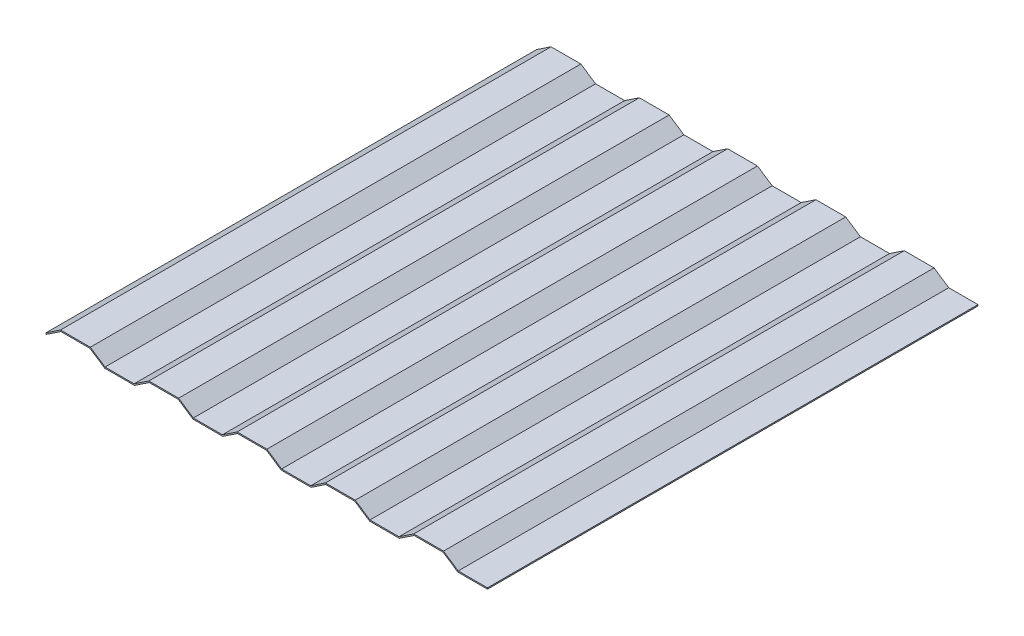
ISO-10303-21;
HEADER;
FILE_DESCRIPTION(('STEP AP214'),'2;1');
FILE_NAME('part.step','',(''),(''),'','','');
FILE_SCHEMA(('AUTOMOTIVE_DESIGN { 1 0 10303 214 1 1 1 1 }'));
ENDSEC;
DATA;
#1=APPLICATION_CONTEXT('core data for automotive mechanical design processes');
#2=APPLICATION_PROTOCOL_DEFINITION('international standard','automotive_design',2000,#1);
#3=PRODUCT_CONTEXT('',#1,'mechanical');
#4=PRODUCT('Part','Part','',(#3));
#5=PRODUCT_RELATED_PRODUCT_CATEGORY('part','',(#4));
#6=PRODUCT_DEFINITION_FORMATION('','',#4);
#7=PRODUCT_DEFINITION_CONTEXT('part definition',#1,'design');
#8=PRODUCT_DEFINITION('design','',#6,#7);
#9=PRODUCT_DEFINITION_SHAPE('','',#8);
#10=(LENGTH_UNIT() NAMED_UNIT(*) SI_UNIT(.MILLI.,.METRE.));
#11=(NAMED_UNIT(*) PLANE_ANGLE_UNIT() SI_UNIT($,.RADIAN.));
#12=(NAMED_UNIT(*) SI_UNIT($,.STERADIAN.) SOLID_ANGLE_UNIT());
#13=UNCERTAINTY_MEASURE_WITH_UNIT(LENGTH_MEASURE(1.E-05),#10,'distance_accuracy_value','');
#14=(GEOMETRIC_REPRESENTATION_CONTEXT(3) GLOBAL_UNCERTAINTY_ASSIGNED_CONTEXT((#13)) GLOBAL_UNIT_ASSIGNED_CONTEXT((#10,
#11,#12)) REPRESENTATION_CONTEXT('',''));
#15=CARTESIAN_POINT('',(0.,0.,0.));
#16=DIRECTION('',(0.,0.,1.));
#17=DIRECTION('',(1.,0.,0.));
#18=AXIS2_PLACEMENT_3D('',#15,#16,#17);
#19=CARTESIAN_POINT('',(420.18894341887,0.624037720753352,250.));
#20=DIRECTION('',(0.,1.,0.));
#21=DIRECTION('',(0.,0.,1.));
#22=AXIS2_PLACEMENT_3D('',#19,#20,#21);
#23=PLANE('',#22);
#24=DIRECTION('',(1.,0.,0.));
#25=VECTOR('',#24,1.);
#26=CARTESIAN_POINT('',(420.18894341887,0.624037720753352,250.));
#27=LINE('',#26,#25);
#28=CARTESIAN_POINT('',(420.18894341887,0.624037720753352,250.));
#29=VERTEX_POINT('',#28);
#30=CARTESIAN_POINT('',(450.,0.624037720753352,250.));
#31=VERTEX_POINT('',#30);
#32=EDGE_CURVE('E921',#29,#31,#27,.T.);
#33=ORIENTED_EDGE('',*,*,#32,.T.);
#34=DIRECTION('',(0.,0.,-1.));
#35=VECTOR('',#34,1.);
#36=CARTESIAN_POINT('',(450.,0.624037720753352,250.));
#37=LINE('',#36,#35);
#38=CARTESIAN_POINT('',(450.,0.624037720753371,-250.));
#39=VERTEX_POINT('',#38);
#40=EDGE_CURVE('E357',#31,#39,#37,.T.);
#41=ORIENTED_EDGE('',*,*,#40,.T.);
#42=DIRECTION('',(1.,0.,0.));
#43=VECTOR('',#42,1.);
#44=CARTESIAN_POINT('',(420.18894341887,0.62403772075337,-250.));
#45=LINE('',#44,#43);
#46=CARTESIAN_POINT('',(420.18894341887,0.62403772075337,-250.));
#47=VERTEX_POINT('',#46);
#48=EDGE_CURVE('E924',#47,#39,#45,.T.);
#49=ORIENTED_EDGE('',*,*,#48,.F.);
#50=DIRECTION('',(0.,0.,1.));
#51=VECTOR('',#50,1.);
#52=CARTESIAN_POINT('',(420.18894341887,0.624037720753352,250.));
#53=LINE('',#52,#51);
#54=EDGE_CURVE('E917',#47,#29,#53,.T.);
#55=ORIENTED_EDGE('',*,*,#54,.T.);
#56=EDGE_LOOP('',(#33,#41,#49,#55));
#57=FACE_BOUND('',#56,.T.);
#58=ADVANCED_FACE('F348',(#57),#23,.T.);
#59=CARTESIAN_POINT('',(419.81105658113,-0.624037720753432,250.));
#60=DIRECTION('',(0.,-1.,0.));
#61=DIRECTION('',(0.,0.,-1.));
#62=AXIS2_PLACEMENT_3D('',#59,#60,#61);
#63=PLANE('',#62);
#64=DIRECTION('',(1.,0.,0.));
#65=VECTOR('',#64,1.);
#66=CARTESIAN_POINT('',(419.81105658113,-0.624037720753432,-250.));
#67=LINE('',#66,#65);
#68=CARTESIAN_POINT('',(419.81105658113,-0.624037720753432,-250.));
#69=VERTEX_POINT('',#68);
#70=CARTESIAN_POINT('',(450.,-0.624037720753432,-250.));
#71=VERTEX_POINT('',#70);
#72=EDGE_CURVE('E926',#69,#71,#67,.T.);
#73=ORIENTED_EDGE('',*,*,#72,.T.);
#74=DIRECTION('',(0.,0.,1.));
#75=VECTOR('',#74,1.);
#76=CARTESIAN_POINT('',(450.,-0.624037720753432,250.));
#77=LINE('',#76,#75);
#78=CARTESIAN_POINT('',(450.,-0.624037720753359,250.));
#79=VERTEX_POINT('',#78);
#80=EDGE_CURVE('E352',#71,#79,#77,.T.);
#81=ORIENTED_EDGE('',*,*,#80,.T.);
#82=DIRECTION('',(1.,0.,0.));
#83=VECTOR('',#82,1.);
#84=CARTESIAN_POINT('',(419.81105658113,-0.624037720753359,250.));
#85=LINE('',#84,#83);
#86=CARTESIAN_POINT('',(419.81105658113,-0.624037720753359,250.));
#87=VERTEX_POINT('',#86);
#88=EDGE_CURVE('E928',#87,#79,#85,.T.);
#89=ORIENTED_EDGE('',*,*,#88,.F.);
#90=DIRECTION('',(0.,0.,-1.));
#91=VECTOR('',#90,1.);
#92=CARTESIAN_POINT('',(419.81105658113,-0.624037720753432,250.));
#93=LINE('',#92,#91);
#94=EDGE_CURVE('E918',#87,#69,#93,.T.);
#95=ORIENTED_EDGE('',*,*,#94,.T.);
#96=EDGE_LOOP('',(#73,#81,#89,#95));
#97=FACE_BOUND('',#96,.T.);
#98=ADVANCED_FACE('F350',(#97),#63,.T.);
#99=CARTESIAN_POINT('',(405.18894341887,10.6240377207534,250.));
#100=DIRECTION('',(-0.554700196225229,-0.832050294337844,0.));
#101=DIRECTION('',(0.832050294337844,-0.554700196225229,0.));
#102=AXIS2_PLACEMENT_3D('',#99,#100,#101);
#103=PLANE('',#102);
#104=ORIENTED_EDGE('',*,*,#54,.F.);
#105=DIRECTION('',(0.832050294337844,-0.554700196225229,0.));
#106=VECTOR('',#105,1.);
#107=CARTESIAN_POINT('',(405.18894341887,10.6240377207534,-250.));
#108=LINE('',#107,#106);
#109=CARTESIAN_POINT('',(405.18894341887,10.6240377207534,-250.));
#110=VERTEX_POINT('',#109);
#111=EDGE_CURVE('E907',#110,#47,#108,.T.);
#112=ORIENTED_EDGE('',*,*,#111,.F.);
#113=DIRECTION('',(0.,0.,-1.));
#114=VECTOR('',#113,1.);
#115=CARTESIAN_POINT('',(405.18894341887,10.6240377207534,250.));
#116=LINE('',#115,#114);
#117=CARTESIAN_POINT('',(405.18894341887,10.6240377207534,250.));
#118=VERTEX_POINT('',#117);
#119=EDGE_CURVE('E903',#118,#110,#116,.T.);
#120=ORIENTED_EDGE('',*,*,#119,.F.);
#121=DIRECTION('',(0.832050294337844,-0.554700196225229,0.));
#122=VECTOR('',#121,1.);
#123=CARTESIAN_POINT('',(405.18894341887,10.6240377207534,250.));
#124=LINE('',#123,#122);
#125=EDGE_CURVE('E904',#118,#29,#124,.T.);
#126=ORIENTED_EDGE('',*,*,#125,.T.);
#127=EDGE_LOOP('',(#104,#112,#120,#126));
#128=FACE_BOUND('',#127,.T.);
#129=ADVANCED_FACE('F1066',(#128),#103,.F.);
#130=CARTESIAN_POINT('',(404.81105658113,9.3759622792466,250.));
#131=DIRECTION('',(0.554700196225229,0.832050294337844,0.));
#132=DIRECTION('',(-0.832050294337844,0.554700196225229,0.));
#133=AXIS2_PLACEMENT_3D('',#130,#131,#132);
#134=PLANE('',#133);
#135=ORIENTED_EDGE('',*,*,#94,.F.);
#136=DIRECTION('',(0.832050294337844,-0.554700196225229,0.));
#137=VECTOR('',#136,1.);
#138=CARTESIAN_POINT('',(404.81105658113,9.37596227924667,250.));
#139=LINE('',#138,#137);
#140=CARTESIAN_POINT('',(404.81105658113,9.37596227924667,250.));
#141=VERTEX_POINT('',#140);
#142=EDGE_CURVE('E914',#141,#87,#139,.T.);
#143=ORIENTED_EDGE('',*,*,#142,.F.);
#144=DIRECTION('',(0.,0.,1.));
#145=VECTOR('',#144,1.);
#146=CARTESIAN_POINT('',(404.81105658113,9.3759622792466,250.));
#147=LINE('',#146,#145);
#148=CARTESIAN_POINT('',(404.81105658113,9.3759622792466,-250.));
#149=VERTEX_POINT('',#148);
#150=EDGE_CURVE('E908',#149,#141,#147,.T.);
#151=ORIENTED_EDGE('',*,*,#150,.F.);
#152=DIRECTION('',(0.832050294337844,-0.554700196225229,0.));
#153=VECTOR('',#152,1.);
#154=CARTESIAN_POINT('',(404.81105658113,9.3759622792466,-250.));
#155=LINE('',#154,#153);
#156=EDGE_CURVE('E911',#149,#69,#155,.T.);
#157=ORIENTED_EDGE('',*,*,#156,.T.);
#158=EDGE_LOOP('',(#135,#143,#151,#157));
#159=FACE_BOUND('',#158,.T.);
#160=ADVANCED_FACE('F1052',(#159),#134,.F.);
#161=CARTESIAN_POINT('',(374.81105658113,10.6240377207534,250.));
#162=DIRECTION('',(0.,1.,0.));
#163=DIRECTION('',(0.,0.,1.));
#164=AXIS2_PLACEMENT_3D('',#161,#162,#163);
#165=PLANE('',#164);
#166=DIRECTION('',(1.,0.,0.));
#167=VECTOR('',#166,1.);
#168=CARTESIAN_POINT('',(374.81105658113,10.6240377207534,250.));
#169=LINE('',#168,#167);
#170=CARTESIAN_POINT('',(374.81105658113,10.6240377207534,250.));
#171=VERTEX_POINT('',#170);
#172=EDGE_CURVE('E900',#171,#118,#169,.T.);
#173=ORIENTED_EDGE('',*,*,#172,.T.);
#174=ORIENTED_EDGE('',*,*,#119,.T.);
#175=DIRECTION('',(1.,0.,0.));
#176=VECTOR('',#175,1.);
#177=CARTESIAN_POINT('',(374.81105658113,10.6240377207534,-250.));
#178=LINE('',#177,#176);
#179=CARTESIAN_POINT('',(374.81105658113,10.6240377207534,-250.));
#180=VERTEX_POINT('',#179);
#181=EDGE_CURVE('E890',#180,#110,#178,.T.);
#182=ORIENTED_EDGE('',*,*,#181,.F.);
#183=DIRECTION('',(0.,0.,1.));
#184=VECTOR('',#183,1.);
#185=CARTESIAN_POINT('',(374.81105658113,10.6240377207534,250.));
#186=LINE('',#185,#184);
#187=EDGE_CURVE('E894',#180,#171,#186,.T.);
#188=ORIENTED_EDGE('',*,*,#187,.T.);
#189=EDGE_LOOP('',(#173,#174,#182,#188));
#190=FACE_BOUND('',#189,.T.);
#191=ADVANCED_FACE('F1070',(#190),#165,.T.);
#192=CARTESIAN_POINT('',(375.18894341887,9.3759622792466,250.));
#193=DIRECTION('',(0.,-1.,0.));
#194=DIRECTION('',(0.,0.,-1.));
#195=AXIS2_PLACEMENT_3D('',#192,#193,#194);
#196=PLANE('',#195);
#197=DIRECTION('',(1.,0.,0.));
#198=VECTOR('',#197,1.);
#199=CARTESIAN_POINT('',(375.18894341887,9.3759622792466,-250.));
#200=LINE('',#199,#198);
#201=CARTESIAN_POINT('',(375.18894341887,9.3759622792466,-250.));
#202=VERTEX_POINT('',#201);
#203=EDGE_CURVE('E893',#202,#149,#200,.T.);
#204=ORIENTED_EDGE('',*,*,#203,.T.);
#205=ORIENTED_EDGE('',*,*,#150,.T.);
#206=DIRECTION('',(1.,0.,0.));
#207=VECTOR('',#206,1.);
#208=CARTESIAN_POINT('',(375.18894341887,9.37596227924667,250.));
#209=LINE('',#208,#207);
#210=CARTESIAN_POINT('',(375.18894341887,9.37596227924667,250.));
#211=VERTEX_POINT('',#210);
#212=EDGE_CURVE('E897',#211,#141,#209,.T.);
#213=ORIENTED_EDGE('',*,*,#212,.F.);
#214=DIRECTION('',(0.,0.,-1.));
#215=VECTOR('',#214,1.);
#216=CARTESIAN_POINT('',(375.18894341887,9.3759622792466,250.));
#217=LINE('',#216,#215);
#218=EDGE_CURVE('E889',#211,#202,#217,.T.);
#219=ORIENTED_EDGE('',*,*,#218,.T.);
#220=EDGE_LOOP('',(#204,#205,#213,#219));
#221=FACE_BOUND('',#220,.T.);
#222=ADVANCED_FACE('F1049',(#221),#196,.T.);
#223=CARTESIAN_POINT('',(359.81105658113,0.624037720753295,250.));
#224=DIRECTION('',(0.554700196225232,-0.832050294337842,0.));
#225=DIRECTION('',(0.832050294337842,0.554700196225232,0.));
#226=AXIS2_PLACEMENT_3D('',#223,#224,#225);
#227=PLANE('',#226);
#228=ORIENTED_EDGE('',*,*,#187,.F.);
#229=DIRECTION('',(0.832050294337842,0.554700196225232,0.));
#230=VECTOR('',#229,1.);
#231=CARTESIAN_POINT('',(359.81105658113,0.624037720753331,-250.));
#232=LINE('',#231,#230);
#233=CARTESIAN_POINT('',(359.81105658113,0.624037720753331,-250.));
#234=VERTEX_POINT('',#233);
#235=EDGE_CURVE('E877',#234,#180,#232,.T.);
#236=ORIENTED_EDGE('',*,*,#235,.F.);
#237=DIRECTION('',(0.,0.,-1.));
#238=VECTOR('',#237,1.);
#239=CARTESIAN_POINT('',(359.81105658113,0.624037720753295,250.));
#240=LINE('',#239,#238);
#241=CARTESIAN_POINT('',(359.81105658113,0.624037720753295,250.));
#242=VERTEX_POINT('',#241);
#243=EDGE_CURVE('E873',#242,#234,#240,.T.);
#244=ORIENTED_EDGE('',*,*,#243,.F.);
#245=DIRECTION('',(0.832050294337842,0.554700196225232,0.));
#246=VECTOR('',#245,1.);
#247=CARTESIAN_POINT('',(359.81105658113,0.624037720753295,250.));
#248=LINE('',#247,#246);
#249=EDGE_CURVE('E886',#242,#171,#248,.T.);
#250=ORIENTED_EDGE('',*,*,#249,.T.);
#251=EDGE_LOOP('',(#228,#236,#244,#250));
#252=FACE_BOUND('',#251,.T.);
#253=ADVANCED_FACE('F1076',(#252),#227,.F.);
#254=CARTESIAN_POINT('',(360.18894341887,-0.62403772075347,250.));
#255=DIRECTION('',(-0.554700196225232,0.832050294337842,0.));
#256=DIRECTION('',(-0.832050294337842,-0.554700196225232,0.));
#257=AXIS2_PLACEMENT_3D('',#254,#255,#256);
#258=PLANE('',#257);
#259=ORIENTED_EDGE('',*,*,#218,.F.);
#260=DIRECTION('',(0.832050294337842,0.554700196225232,0.));
#261=VECTOR('',#260,1.);
#262=CARTESIAN_POINT('',(360.18894341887,-0.624037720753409,250.));
#263=LINE('',#262,#261);
#264=CARTESIAN_POINT('',(360.18894341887,-0.624037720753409,250.));
#265=VERTEX_POINT('',#264);
#266=EDGE_CURVE('E883',#265,#211,#263,.T.);
#267=ORIENTED_EDGE('',*,*,#266,.F.);
#268=DIRECTION('',(0.,0.,1.));
#269=VECTOR('',#268,1.);
#270=CARTESIAN_POINT('',(360.18894341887,-0.62403772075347,250.));
#271=LINE('',#270,#269);
#272=CARTESIAN_POINT('',(360.18894341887,-0.62403772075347,-250.));
#273=VERTEX_POINT('',#272);
#274=EDGE_CURVE('E876',#273,#265,#271,.T.);
#275=ORIENTED_EDGE('',*,*,#274,.F.);
#276=DIRECTION('',(0.832050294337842,0.554700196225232,0.));
#277=VECTOR('',#276,1.);
#278=CARTESIAN_POINT('',(360.18894341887,-0.62403772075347,-250.));
#279=LINE('',#278,#277);
#280=EDGE_CURVE('E880',#273,#202,#279,.T.);
#281=ORIENTED_EDGE('',*,*,#280,.T.);
#282=EDGE_LOOP('',(#259,#267,#275,#281));
#283=FACE_BOUND('',#282,.T.);
#284=ADVANCED_FACE('F1046',(#283),#258,.F.);
#285=CARTESIAN_POINT('',(329.81105658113,-0.62403772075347,250.));
#286=DIRECTION('',(0.,-1.,0.));
#287=DIRECTION('',(0.,0.,-1.));
#288=AXIS2_PLACEMENT_3D('',#285,#286,#287);
#289=PLANE('',#288);
#290=DIRECTION('',(1.,0.,0.));
#291=VECTOR('',#290,1.);
#292=CARTESIAN_POINT('',(329.81105658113,-0.62403772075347,-250.));
#293=LINE('',#292,#291);
#294=CARTESIAN_POINT('',(329.81105658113,-0.62403772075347,-250.));
#295=VERTEX_POINT('',#294);
#296=EDGE_CURVE('E861',#295,#273,#293,.T.);
#297=ORIENTED_EDGE('',*,*,#296,.T.);
#298=ORIENTED_EDGE('',*,*,#274,.T.);
#299=DIRECTION('',(1.,0.,0.));
#300=VECTOR('',#299,1.);
#301=CARTESIAN_POINT('',(329.81105658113,-0.624037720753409,250.));
#302=LINE('',#301,#300);
#303=CARTESIAN_POINT('',(329.81105658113,-0.624037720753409,250.));
#304=VERTEX_POINT('',#303);
#305=EDGE_CURVE('E864',#304,#265,#302,.T.);
#306=ORIENTED_EDGE('',*,*,#305,.F.);
#307=DIRECTION('',(0.,0.,-1.));
#308=VECTOR('',#307,1.);
#309=CARTESIAN_POINT('',(329.81105658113,-0.62403772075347,250.));
#310=LINE('',#309,#308);
#311=EDGE_CURVE('E857',#304,#295,#310,.T.);
#312=ORIENTED_EDGE('',*,*,#311,.T.);
#313=EDGE_LOOP('',(#297,#298,#306,#312));
#314=FACE_BOUND('',#313,.T.);
#315=ADVANCED_FACE('F1042',(#314),#289,.T.);
#316=CARTESIAN_POINT('',(330.18894341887,0.624037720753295,250.));
#317=DIRECTION('',(0.,1.,0.));
#318=DIRECTION('',(0.,0.,1.));
#319=AXIS2_PLACEMENT_3D('',#316,#317,#318);
#320=PLANE('',#319);
#321=DIRECTION('',(1.,0.,0.));
#322=VECTOR('',#321,1.);
#323=CARTESIAN_POINT('',(330.18894341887,0.624037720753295,250.));
#324=LINE('',#323,#322);
#325=CARTESIAN_POINT('',(330.18894341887,0.624037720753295,250.));
#326=VERTEX_POINT('',#325);
#327=EDGE_CURVE('E867',#326,#242,#324,.T.);
#328=ORIENTED_EDGE('',*,*,#327,.T.);
#329=ORIENTED_EDGE('',*,*,#243,.T.);
#330=DIRECTION('',(1.,0.,0.));
#331=VECTOR('',#330,1.);
#332=CARTESIAN_POINT('',(330.18894341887,0.624037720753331,-250.));
#333=LINE('',#332,#331);
#334=CARTESIAN_POINT('',(330.18894341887,0.624037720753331,-250.));
#335=VERTEX_POINT('',#334);
#336=EDGE_CURVE('E870',#335,#234,#333,.T.);
#337=ORIENTED_EDGE('',*,*,#336,.F.);
#338=DIRECTION('',(0.,0.,1.));
#339=VECTOR('',#338,1.);
#340=CARTESIAN_POINT('',(330.18894341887,0.624037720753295,250.));
#341=LINE('',#340,#339);
#342=EDGE_CURVE('E858',#335,#326,#341,.T.);
#343=ORIENTED_EDGE('',*,*,#342,.T.);
#344=EDGE_LOOP('',(#328,#329,#337,#343));
#345=FACE_BOUND('',#344,.T.);
#346=ADVANCED_FACE('F1085',(#345),#320,.T.);
#347=CARTESIAN_POINT('',(314.81105658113,9.37596227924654,250.));
#348=DIRECTION('',(0.554700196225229,0.832050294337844,0.));
#349=DIRECTION('',(-0.832050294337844,0.554700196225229,0.));
#350=AXIS2_PLACEMENT_3D('',#347,#348,#349);
#351=PLANE('',#350);
#352=ORIENTED_EDGE('',*,*,#311,.F.);
#353=DIRECTION('',(0.832050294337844,-0.554700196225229,0.));
#354=VECTOR('',#353,1.);
#355=CARTESIAN_POINT('',(314.81105658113,9.37596227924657,250.));
#356=LINE('',#355,#354);
#357=CARTESIAN_POINT('',(314.81105658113,9.37596227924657,250.));
#358=VERTEX_POINT('',#357);
#359=EDGE_CURVE('E847',#358,#304,#356,.T.);
#360=ORIENTED_EDGE('',*,*,#359,.F.);
#361=DIRECTION('',(0.,0.,1.));
#362=VECTOR('',#361,1.);
#363=CARTESIAN_POINT('',(314.81105658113,9.37596227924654,250.));
#364=LINE('',#363,#362);
#365=CARTESIAN_POINT('',(314.81105658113,9.37596227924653,-250.));
#366=VERTEX_POINT('',#365);
#367=EDGE_CURVE('E843',#366,#358,#364,.T.);
#368=ORIENTED_EDGE('',*,*,#367,.F.);
#369=DIRECTION('',(0.832050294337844,-0.554700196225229,0.));
#370=VECTOR('',#369,1.);
#371=CARTESIAN_POINT('',(314.81105658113,9.37596227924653,-250.));
#372=LINE('',#371,#370);
#373=EDGE_CURVE('E844',#366,#295,#372,.T.);
#374=ORIENTED_EDGE('',*,*,#373,.T.);
#375=EDGE_LOOP('',(#352,#360,#368,#374));
#376=FACE_BOUND('',#375,.T.);
#377=ADVANCED_FACE('F1040',(#376),#351,.F.);
#378=CARTESIAN_POINT('',(315.18894341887,10.6240377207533,250.));
#379=DIRECTION('',(-0.554700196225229,-0.832050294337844,0.));
#380=DIRECTION('',(0.832050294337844,-0.554700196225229,0.));
#381=AXIS2_PLACEMENT_3D('',#378,#379,#380);
#382=PLANE('',#381);
#383=ORIENTED_EDGE('',*,*,#342,.F.);
#384=DIRECTION('',(0.832050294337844,-0.554700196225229,0.));
#385=VECTOR('',#384,1.);
#386=CARTESIAN_POINT('',(315.18894341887,10.6240377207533,-250.));
#387=LINE('',#386,#385);
#388=CARTESIAN_POINT('',(315.18894341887,10.6240377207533,-250.));
#389=VERTEX_POINT('',#388);
#390=EDGE_CURVE('E854',#389,#335,#387,.T.);
#391=ORIENTED_EDGE('',*,*,#390,.F.);
#392=DIRECTION('',(0.,0.,-1.));
#393=VECTOR('',#392,1.);
#394=CARTESIAN_POINT('',(315.18894341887,10.6240377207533,250.));
#395=LINE('',#394,#393);
#396=CARTESIAN_POINT('',(315.18894341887,10.6240377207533,250.));
#397=VERTEX_POINT('',#396);
#398=EDGE_CURVE('E848',#397,#389,#395,.T.);
#399=ORIENTED_EDGE('',*,*,#398,.F.);
#400=DIRECTION('',(0.832050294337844,-0.554700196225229,0.));
#401=VECTOR('',#400,1.);
#402=CARTESIAN_POINT('',(315.18894341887,10.6240377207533,250.));
#403=LINE('',#402,#401);
#404=EDGE_CURVE('E851',#397,#326,#403,.T.);
#405=ORIENTED_EDGE('',*,*,#404,.T.);
#406=EDGE_LOOP('',(#383,#391,#399,#405));
#407=FACE_BOUND('',#406,.T.);
#408=ADVANCED_FACE('F1091',(#407),#382,.F.);
#409=CARTESIAN_POINT('',(285.18894341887,9.37596227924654,250.));
#410=DIRECTION('',(0.,-1.,0.));
#411=DIRECTION('',(0.,0.,-1.));
#412=AXIS2_PLACEMENT_3D('',#409,#410,#411);
#413=PLANE('',#412);
#414=DIRECTION('',(1.,0.,0.));
#415=VECTOR('',#414,1.);
#416=CARTESIAN_POINT('',(285.18894341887,9.37596227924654,-250.));
#417=LINE('',#416,#415);
#418=CARTESIAN_POINT('',(285.18894341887,9.37596227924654,-250.));
#419=VERTEX_POINT('',#418);
#420=EDGE_CURVE('E840',#419,#366,#417,.T.);
#421=ORIENTED_EDGE('',*,*,#420,.T.);
#422=ORIENTED_EDGE('',*,*,#367,.T.);
#423=DIRECTION('',(1.,0.,0.));
#424=VECTOR('',#423,1.);
#425=CARTESIAN_POINT('',(285.18894341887,9.37596227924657,250.));
#426=LINE('',#425,#424);
#427=CARTESIAN_POINT('',(285.18894341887,9.37596227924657,250.));
#428=VERTEX_POINT('',#427);
#429=EDGE_CURVE('E830',#428,#358,#426,.T.);
#430=ORIENTED_EDGE('',*,*,#429,.F.);
#431=DIRECTION('',(0.,0.,-1.));
#432=VECTOR('',#431,1.);
#433=CARTESIAN_POINT('',(285.18894341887,9.37596227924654,250.));
#434=LINE('',#433,#432);
#435=EDGE_CURVE('E834',#428,#419,#434,.T.);
#436=ORIENTED_EDGE('',*,*,#435,.T.);
#437=EDGE_LOOP('',(#421,#422,#430,#436));
#438=FACE_BOUND('',#437,.T.);
#439=ADVANCED_FACE('F1036',(#438),#413,.T.);
#440=CARTESIAN_POINT('',(284.81105658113,10.6240377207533,250.));
#441=DIRECTION('',(0.,1.,0.));
#442=DIRECTION('',(0.,0.,1.));
#443=AXIS2_PLACEMENT_3D('',#440,#441,#442);
#444=PLANE('',#443);
#445=DIRECTION('',(1.,0.,0.));
#446=VECTOR('',#445,1.);
#447=CARTESIAN_POINT('',(284.81105658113,10.6240377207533,250.));
#448=LINE('',#447,#446);
#449=CARTESIAN_POINT('',(284.81105658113,10.6240377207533,250.));
#450=VERTEX_POINT('',#449);
#451=EDGE_CURVE('E833',#450,#397,#448,.T.);
#452=ORIENTED_EDGE('',*,*,#451,.T.);
#453=ORIENTED_EDGE('',*,*,#398,.T.);
#454=DIRECTION('',(1.,0.,0.));
#455=VECTOR('',#454,1.);
#456=CARTESIAN_POINT('',(284.81105658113,10.6240377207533,-250.));
#457=LINE('',#456,#455);
#458=CARTESIAN_POINT('',(284.81105658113,10.6240377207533,-250.));
#459=VERTEX_POINT('',#458);
#460=EDGE_CURVE('E837',#459,#389,#457,.T.);
#461=ORIENTED_EDGE('',*,*,#460,.F.);
#462=DIRECTION('',(0.,0.,1.));
#463=VECTOR('',#462,1.);
#464=CARTESIAN_POINT('',(284.81105658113,10.6240377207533,250.));
#465=LINE('',#464,#463);
#466=EDGE_CURVE('E829',#459,#450,#465,.T.);
#467=ORIENTED_EDGE('',*,*,#466,.T.);
#468=EDGE_LOOP('',(#452,#453,#461,#467));
#469=FACE_BOUND('',#468,.T.);
#470=ADVANCED_FACE('F1097',(#469),#444,.T.);
#471=CARTESIAN_POINT('',(270.18894341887,-0.624037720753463,250.));
#472=DIRECTION('',(-0.554700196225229,0.832050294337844,0.));
#473=DIRECTION('',(-0.832050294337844,-0.554700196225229,0.));
#474=AXIS2_PLACEMENT_3D('',#471,#472,#473);
#475=PLANE('',#474);
#476=ORIENTED_EDGE('',*,*,#435,.F.);
#477=DIRECTION('',(0.832050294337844,0.554700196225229,0.));
#478=VECTOR('',#477,1.);
#479=CARTESIAN_POINT('',(270.18894341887,-0.624037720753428,250.));
#480=LINE('',#479,#478);
#481=CARTESIAN_POINT('',(270.18894341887,-0.624037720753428,250.));
#482=VERTEX_POINT('',#481);
#483=EDGE_CURVE('E817',#482,#428,#480,.T.);
#484=ORIENTED_EDGE('',*,*,#483,.F.);
#485=DIRECTION('',(0.,0.,1.));
#486=VECTOR('',#485,1.);
#487=CARTESIAN_POINT('',(270.18894341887,-0.624037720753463,250.));
#488=LINE('',#487,#486);
#489=CARTESIAN_POINT('',(270.18894341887,-0.624037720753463,-250.));
#490=VERTEX_POINT('',#489);
#491=EDGE_CURVE('E813',#490,#482,#488,.T.);
#492=ORIENTED_EDGE('',*,*,#491,.F.);
#493=DIRECTION('',(0.832050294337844,0.554700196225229,0.));
#494=VECTOR('',#493,1.);
#495=CARTESIAN_POINT('',(270.18894341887,-0.624037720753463,-250.));
#496=LINE('',#495,#494);
#497=EDGE_CURVE('E826',#490,#419,#496,.T.);
#498=ORIENTED_EDGE('',*,*,#497,.T.);
#499=EDGE_LOOP('',(#476,#484,#492,#498));
#500=FACE_BOUND('',#499,.T.);
#501=ADVANCED_FACE('F1034',(#500),#475,.F.);
#502=CARTESIAN_POINT('',(269.81105658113,0.62403772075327,250.));
#503=DIRECTION('',(0.554700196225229,-0.832050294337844,0.));
#504=DIRECTION('',(0.832050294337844,0.554700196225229,0.));
#505=AXIS2_PLACEMENT_3D('',#502,#503,#504);
#506=PLANE('',#505);
#507=ORIENTED_EDGE('',*,*,#466,.F.);
#508=DIRECTION('',(0.832050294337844,0.554700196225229,0.));
#509=VECTOR('',#508,1.);
#510=CARTESIAN_POINT('',(269.81105658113,0.62403772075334,-250.));
#511=LINE('',#510,#509);
#512=CARTESIAN_POINT('',(269.81105658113,0.62403772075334,-250.));
#513=VERTEX_POINT('',#512);
#514=EDGE_CURVE('E823',#513,#459,#511,.T.);
#515=ORIENTED_EDGE('',*,*,#514,.F.);
#516=DIRECTION('',(0.,0.,-1.));
#517=VECTOR('',#516,1.);
#518=CARTESIAN_POINT('',(269.81105658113,0.62403772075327,250.));
#519=LINE('',#518,#517);
#520=CARTESIAN_POINT('',(269.81105658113,0.62403772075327,250.));
#521=VERTEX_POINT('',#520);
#522=EDGE_CURVE('E816',#521,#513,#519,.T.);
#523=ORIENTED_EDGE('',*,*,#522,.F.);
#524=DIRECTION('',(0.832050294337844,0.554700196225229,0.));
#525=VECTOR('',#524,1.);
#526=CARTESIAN_POINT('',(269.81105658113,0.62403772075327,250.));
#527=LINE('',#526,#525);
#528=EDGE_CURVE('E820',#521,#450,#527,.T.);
#529=ORIENTED_EDGE('',*,*,#528,.T.);
#530=EDGE_LOOP('',(#507,#515,#523,#529));
#531=FACE_BOUND('',#530,.T.);
#532=ADVANCED_FACE('F1103',(#531),#506,.F.);
#533=CARTESIAN_POINT('',(240.18894341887,0.62403772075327,250.));
#534=DIRECTION('',(0.,1.,0.));
#535=DIRECTION('',(0.,0.,1.));
#536=AXIS2_PLACEMENT_3D('',#533,#534,#535);
#537=PLANE('',#536);
#538=DIRECTION('',(1.,0.,0.));
#539=VECTOR('',#538,1.);
#540=CARTESIAN_POINT('',(240.18894341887,0.62403772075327,250.));
#541=LINE('',#540,#539);
#542=CARTESIAN_POINT('',(240.18894341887,0.62403772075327,250.));
#543=VERTEX_POINT('',#542);
#544=EDGE_CURVE('E801',#543,#521,#541,.T.);
#545=ORIENTED_EDGE('',*,*,#544,.T.);
#546=ORIENTED_EDGE('',*,*,#522,.T.);
#547=DIRECTION('',(1.,0.,0.));
#548=VECTOR('',#547,1.);
#549=CARTESIAN_POINT('',(240.18894341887,0.624037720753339,-250.));
#550=LINE('',#549,#548);
#551=CARTESIAN_POINT('',(240.18894341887,0.624037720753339,-250.));
#552=VERTEX_POINT('',#551);
#553=EDGE_CURVE('E804',#552,#513,#550,.T.);
#554=ORIENTED_EDGE('',*,*,#553,.F.);
#555=DIRECTION('',(0.,0.,1.));
#556=VECTOR('',#555,1.);
#557=CARTESIAN_POINT('',(240.18894341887,0.62403772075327,250.));
#558=LINE('',#557,#556);
#559=EDGE_CURVE('E797',#552,#543,#558,.T.);
#560=ORIENTED_EDGE('',*,*,#559,.T.);
#561=EDGE_LOOP('',(#545,#546,#554,#560));
#562=FACE_BOUND('',#561,.T.);
#563=ADVANCED_FACE('F1106',(#562),#537,.T.);
#564=CARTESIAN_POINT('',(239.81105658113,-0.624037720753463,250.));
#565=DIRECTION('',(0.,-1.,0.));
#566=DIRECTION('',(0.,0.,-1.));
#567=AXIS2_PLACEMENT_3D('',#564,#565,#566);
#568=PLANE('',#567);
#569=DIRECTION('',(1.,0.,0.));
#570=VECTOR('',#569,1.);
#571=CARTESIAN_POINT('',(239.81105658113,-0.624037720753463,-250.));
#572=LINE('',#571,#570);
#573=CARTESIAN_POINT('',(239.81105658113,-0.624037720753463,-250.));
#574=VERTEX_POINT('',#573);
#575=EDGE_CURVE('E807',#574,#490,#572,.T.);
#576=ORIENTED_EDGE('',*,*,#575,.T.);
#577=ORIENTED_EDGE('',*,*,#491,.T.);
#578=DIRECTION('',(1.,0.,0.));
#579=VECTOR('',#578,1.);
#580=CARTESIAN_POINT('',(239.81105658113,-0.624037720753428,250.));
#581=LINE('',#580,#579);
#582=CARTESIAN_POINT('',(239.81105658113,-0.624037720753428,250.));
#583=VERTEX_POINT('',#582);
#584=EDGE_CURVE('E810',#583,#482,#581,.T.);
#585=ORIENTED_EDGE('',*,*,#584,.F.);
#586=DIRECTION('',(0.,0.,-1.));
#587=VECTOR('',#586,1.);
#588=CARTESIAN_POINT('',(239.81105658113,-0.624037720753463,250.));
#589=LINE('',#588,#587);
#590=EDGE_CURVE('E798',#583,#574,#589,.T.);
#591=ORIENTED_EDGE('',*,*,#590,.T.);
#592=EDGE_LOOP('',(#576,#577,#585,#591));
#593=FACE_BOUND('',#592,.T.);
#594=ADVANCED_FACE('F1031',(#593),#568,.T.);
#595=CARTESIAN_POINT('',(225.18894341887,10.6240377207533,250.));
#596=DIRECTION('',(-0.554700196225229,-0.832050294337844,0.));
#597=DIRECTION('',(0.832050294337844,-0.554700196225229,0.));
#598=AXIS2_PLACEMENT_3D('',#595,#596,#597);
#599=PLANE('',#598);
#600=ORIENTED_EDGE('',*,*,#559,.F.);
#601=DIRECTION('',(0.832050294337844,-0.554700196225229,0.));
#602=VECTOR('',#601,1.);
#603=CARTESIAN_POINT('',(225.18894341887,10.6240377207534,-250.));
#604=LINE('',#603,#602);
#605=CARTESIAN_POINT('',(225.18894341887,10.6240377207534,-250.));
#606=VERTEX_POINT('',#605);
#607=EDGE_CURVE('E787',#606,#552,#604,.T.);
#608=ORIENTED_EDGE('',*,*,#607,.F.);
#609=DIRECTION('',(0.,0.,-1.));
#610=VECTOR('',#609,1.);
#611=CARTESIAN_POINT('',(225.18894341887,10.6240377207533,250.));
#612=LINE('',#611,#610);
#613=CARTESIAN_POINT('',(225.18894341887,10.6240377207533,250.));
#614=VERTEX_POINT('',#613);
#615=EDGE_CURVE('E783',#614,#606,#612,.T.);
#616=ORIENTED_EDGE('',*,*,#615,.F.);
#617=DIRECTION('',(0.832050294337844,-0.554700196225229,0.));
#618=VECTOR('',#617,1.);
#619=CARTESIAN_POINT('',(225.18894341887,10.6240377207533,250.));
#620=LINE('',#619,#618);
#621=EDGE_CURVE('E784',#614,#543,#620,.T.);
#622=ORIENTED_EDGE('',*,*,#621,.T.);
#623=EDGE_LOOP('',(#600,#608,#616,#622));
#624=FACE_BOUND('',#623,.T.);
#625=ADVANCED_FACE('F1112',(#624),#599,.F.);
#626=CARTESIAN_POINT('',(224.81105658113,9.37596227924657,250.));
#627=DIRECTION('',(0.554700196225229,0.832050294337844,0.));
#628=DIRECTION('',(-0.832050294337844,0.554700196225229,0.));
#629=AXIS2_PLACEMENT_3D('',#626,#627,#628);
#630=PLANE('',#629);
#631=ORIENTED_EDGE('',*,*,#590,.F.);
#632=DIRECTION('',(0.832050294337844,-0.554700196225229,0.));
#633=VECTOR('',#632,1.);
#634=CARTESIAN_POINT('',(224.81105658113,9.37596227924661,250.));
#635=LINE('',#634,#633);
#636=CARTESIAN_POINT('',(224.81105658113,9.37596227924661,250.));
#637=VERTEX_POINT('',#636);
#638=EDGE_CURVE('E794',#637,#583,#635,.T.);
#639=ORIENTED_EDGE('',*,*,#638,.F.);
#640=DIRECTION('',(0.,0.,1.));
#641=VECTOR('',#640,1.);
#642=CARTESIAN_POINT('',(224.81105658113,9.37596227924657,250.));
#643=LINE('',#642,#641);
#644=CARTESIAN_POINT('',(224.81105658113,9.37596227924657,-250.));
#645=VERTEX_POINT('',#644);
#646=EDGE_CURVE('E788',#645,#637,#643,.T.);
#647=ORIENTED_EDGE('',*,*,#646,.F.);
#648=DIRECTION('',(0.832050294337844,-0.554700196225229,0.));
#649=VECTOR('',#648,1.);
#650=CARTESIAN_POINT('',(224.81105658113,9.37596227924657,-250.));
#651=LINE('',#650,#649);
#652=EDGE_CURVE('E791',#645,#574,#651,.T.);
#653=ORIENTED_EDGE('',*,*,#652,.T.);
#654=EDGE_LOOP('',(#631,#639,#647,#653));
#655=FACE_BOUND('',#654,.T.);
#656=ADVANCED_FACE('F1028',(#655),#630,.F.);
#657=CARTESIAN_POINT('',(194.81105658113,10.6240377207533,250.));
#658=DIRECTION('',(0.,1.,0.));
#659=DIRECTION('',(0.,0.,1.));
#660=AXIS2_PLACEMENT_3D('',#657,#658,#659);
#661=PLANE('',#660);
#662=DIRECTION('',(1.,0.,0.));
#663=VECTOR('',#662,1.);
#664=CARTESIAN_POINT('',(194.81105658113,10.6240377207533,250.));
#665=LINE('',#664,#663);
#666=CARTESIAN_POINT('',(194.81105658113,10.6240377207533,250.));
#667=VERTEX_POINT('',#666);
#668=EDGE_CURVE('E780',#667,#614,#665,.T.);
#669=ORIENTED_EDGE('',*,*,#668,.T.);
#670=ORIENTED_EDGE('',*,*,#615,.T.);
#671=DIRECTION('',(1.,0.,0.));
#672=VECTOR('',#671,1.);
#673=CARTESIAN_POINT('',(194.81105658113,10.6240377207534,-250.));
#674=LINE('',#673,#672);
#675=CARTESIAN_POINT('',(194.81105658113,10.6240377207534,-250.));
#676=VERTEX_POINT('',#675);
#677=EDGE_CURVE('E770',#676,#606,#674,.T.);
#678=ORIENTED_EDGE('',*,*,#677,.F.);
#679=DIRECTION('',(0.,0.,1.));
#680=VECTOR('',#679,1.);
#681=CARTESIAN_POINT('',(194.81105658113,10.6240377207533,250.));
#682=LINE('',#681,#680);
#683=EDGE_CURVE('E774',#676,#667,#682,.T.);
#684=ORIENTED_EDGE('',*,*,#683,.T.);
#685=EDGE_LOOP('',(#669,#670,#678,#684));
#686=FACE_BOUND('',#685,.T.);
#687=ADVANCED_FACE('F1118',(#686),#661,.T.);
#688=CARTESIAN_POINT('',(195.18894341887,9.37596227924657,250.));
#689=DIRECTION('',(0.,-1.,0.));
#690=DIRECTION('',(0.,0.,-1.));
#691=AXIS2_PLACEMENT_3D('',#688,#689,#690);
#692=PLANE('',#691);
#693=DIRECTION('',(1.,0.,0.));
#694=VECTOR('',#693,1.);
#695=CARTESIAN_POINT('',(195.18894341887,9.37596227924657,-250.));
#696=LINE('',#695,#694);
#697=CARTESIAN_POINT('',(195.18894341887,9.37596227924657,-250.));
#698=VERTEX_POINT('',#697);
#699=EDGE_CURVE('E773',#698,#645,#696,.T.);
#700=ORIENTED_EDGE('',*,*,#699,.T.);
#701=ORIENTED_EDGE('',*,*,#646,.T.);
#702=DIRECTION('',(1.,0.,0.));
#703=VECTOR('',#702,1.);
#704=CARTESIAN_POINT('',(195.18894341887,9.37596227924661,250.));
#705=LINE('',#704,#703);
#706=CARTESIAN_POINT('',(195.18894341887,9.37596227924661,250.));
#707=VERTEX_POINT('',#706);
#708=EDGE_CURVE('E777',#707,#637,#705,.T.);
#709=ORIENTED_EDGE('',*,*,#708,.F.);
#710=DIRECTION('',(0.,0.,-1.));
#711=VECTOR('',#710,1.);
#712=CARTESIAN_POINT('',(195.18894341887,9.37596227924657,250.));
#713=LINE('',#712,#711);
#714=EDGE_CURVE('E769',#707,#698,#713,.T.);
#715=ORIENTED_EDGE('',*,*,#714,.T.);
#716=EDGE_LOOP('',(#700,#701,#709,#715));
#717=FACE_BOUND('',#716,.T.);
#718=ADVANCED_FACE('F1024',(#717),#692,.T.);
#719=CARTESIAN_POINT('',(179.81105658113,0.624037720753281,250.));
#720=DIRECTION('',(0.55470019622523,-0.832050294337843,0.));
#721=DIRECTION('',(0.832050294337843,0.55470019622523,0.));
#722=AXIS2_PLACEMENT_3D('',#719,#720,#721);
#723=PLANE('',#722);
#724=ORIENTED_EDGE('',*,*,#683,.F.);
#725=DIRECTION('',(0.832050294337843,0.55470019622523,0.));
#726=VECTOR('',#725,1.);
#727=CARTESIAN_POINT('',(179.81105658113,0.624037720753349,-250.));
#728=LINE('',#727,#726);
#729=CARTESIAN_POINT('',(179.81105658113,0.624037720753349,-250.));
#730=VERTEX_POINT('',#729);
#731=EDGE_CURVE('E757',#730,#676,#728,.T.);
#732=ORIENTED_EDGE('',*,*,#731,.F.);
#733=DIRECTION('',(0.,0.,-1.));
#734=VECTOR('',#733,1.);
#735=CARTESIAN_POINT('',(179.81105658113,0.624037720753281,250.));
#736=LINE('',#735,#734);
#737=CARTESIAN_POINT('',(179.81105658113,0.624037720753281,250.));
#738=VERTEX_POINT('',#737);
#739=EDGE_CURVE('E753',#738,#730,#736,.T.);
#740=ORIENTED_EDGE('',*,*,#739,.F.);
#741=DIRECTION('',(0.832050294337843,0.55470019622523,0.));
#742=VECTOR('',#741,1.);
#743=CARTESIAN_POINT('',(179.81105658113,0.624037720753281,250.));
#744=LINE('',#743,#742);
#745=EDGE_CURVE('E766',#738,#667,#744,.T.);
#746=ORIENTED_EDGE('',*,*,#745,.T.);
#747=EDGE_LOOP('',(#724,#732,#740,#746));
#748=FACE_BOUND('',#747,.T.);
#749=ADVANCED_FACE('F1124',(#748),#723,.F.);
#750=CARTESIAN_POINT('',(180.18894341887,-0.624037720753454,250.));
#751=DIRECTION('',(-0.55470019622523,0.832050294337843,0.));
#752=DIRECTION('',(-0.832050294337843,-0.55470019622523,0.));
#753=AXIS2_PLACEMENT_3D('',#750,#751,#752);
#754=PLANE('',#753);
#755=ORIENTED_EDGE('',*,*,#714,.F.);
#756=DIRECTION('',(0.832050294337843,0.55470019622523,0.));
#757=VECTOR('',#756,1.);
#758=CARTESIAN_POINT('',(180.18894341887,-0.624037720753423,250.));
#759=LINE('',#758,#757);
#760=CARTESIAN_POINT('',(180.18894341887,-0.624037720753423,250.));
#761=VERTEX_POINT('',#760);
#762=EDGE_CURVE('E763',#761,#707,#759,.T.);
#763=ORIENTED_EDGE('',*,*,#762,.F.);
#764=DIRECTION('',(0.,0.,1.));
#765=VECTOR('',#764,1.);
#766=CARTESIAN_POINT('',(180.18894341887,-0.624037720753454,250.));
#767=LINE('',#766,#765);
#768=CARTESIAN_POINT('',(180.18894341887,-0.624037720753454,-250.));
#769=VERTEX_POINT('',#768);
#770=EDGE_CURVE('E756',#769,#761,#767,.T.);
#771=ORIENTED_EDGE('',*,*,#770,.F.);
#772=DIRECTION('',(0.832050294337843,0.55470019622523,0.));
#773=VECTOR('',#772,1.);
#774=CARTESIAN_POINT('',(180.18894341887,-0.624037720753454,-250.));
#775=LINE('',#774,#773);
#776=EDGE_CURVE('E760',#769,#698,#775,.T.);
#777=ORIENTED_EDGE('',*,*,#776,.T.);
#778=EDGE_LOOP('',(#755,#763,#771,#777));
#779=FACE_BOUND('',#778,.T.);
#780=ADVANCED_FACE('F1022',(#779),#754,.F.);
#781=CARTESIAN_POINT('',(149.81105658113,-0.624037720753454,250.));
#782=DIRECTION('',(0.,-1.,0.));
#783=DIRECTION('',(0.,0.,-1.));
#784=AXIS2_PLACEMENT_3D('',#781,#782,#783);
#785=PLANE('',#784);
#786=DIRECTION('',(1.,0.,0.));
#787=VECTOR('',#786,1.);
#788=CARTESIAN_POINT('',(149.81105658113,-0.624037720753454,-250.));
#789=LINE('',#788,#787);
#790=CARTESIAN_POINT('',(149.81105658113,-0.624037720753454,-250.));
#791=VERTEX_POINT('',#790);
#792=EDGE_CURVE('E741',#791,#769,#789,.T.);
#793=ORIENTED_EDGE('',*,*,#792,.T.);
#794=ORIENTED_EDGE('',*,*,#770,.T.);
#795=DIRECTION('',(1.,0.,0.));
#796=VECTOR('',#795,1.);
#797=CARTESIAN_POINT('',(149.81105658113,-0.624037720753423,250.));
#798=LINE('',#797,#796);
#799=CARTESIAN_POINT('',(149.81105658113,-0.624037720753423,250.));
#800=VERTEX_POINT('',#799);
#801=EDGE_CURVE('E744',#800,#761,#798,.T.);
#802=ORIENTED_EDGE('',*,*,#801,.F.);
#803=DIRECTION('',(0.,0.,-1.));
#804=VECTOR('',#803,1.);
#805=CARTESIAN_POINT('',(149.81105658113,-0.624037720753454,250.));
#806=LINE('',#805,#804);
#807=EDGE_CURVE('E737',#800,#791,#806,.T.);
#808=ORIENTED_EDGE('',*,*,#807,.T.);
#809=EDGE_LOOP('',(#793,#794,#802,#808));
#810=FACE_BOUND('',#809,.T.);
#811=ADVANCED_FACE('F1018',(#810),#785,.T.);
#812=CARTESIAN_POINT('',(150.18894341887,0.624037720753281,250.));
#813=DIRECTION('',(0.,1.,0.));
#814=DIRECTION('',(0.,0.,1.));
#815=AXIS2_PLACEMENT_3D('',#812,#813,#814);
#816=PLANE('',#815);
#817=DIRECTION('',(1.,0.,0.));
#818=VECTOR('',#817,1.);
#819=CARTESIAN_POINT('',(150.18894341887,0.624037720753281,250.));
#820=LINE('',#819,#818);
#821=CARTESIAN_POINT('',(150.18894341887,0.624037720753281,250.));
#822=VERTEX_POINT('',#821);
#823=EDGE_CURVE('E747',#822,#738,#820,.T.);
#824=ORIENTED_EDGE('',*,*,#823,.T.);
#825=ORIENTED_EDGE('',*,*,#739,.T.);
#826=DIRECTION('',(1.,0.,0.));
#827=VECTOR('',#826,1.);
#828=CARTESIAN_POINT('',(150.18894341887,0.624037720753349,-250.));
#829=LINE('',#828,#827);
#830=CARTESIAN_POINT('',(150.18894341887,0.624037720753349,-250.));
#831=VERTEX_POINT('',#830);
#832=EDGE_CURVE('E750',#831,#730,#829,.T.);
#833=ORIENTED_EDGE('',*,*,#832,.F.);
#834=DIRECTION('',(0.,0.,1.));
#835=VECTOR('',#834,1.);
#836=CARTESIAN_POINT('',(150.18894341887,0.624037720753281,250.));
#837=LINE('',#836,#835);
#838=EDGE_CURVE('E738',#831,#822,#837,.T.);
#839=ORIENTED_EDGE('',*,*,#838,.T.);
#840=EDGE_LOOP('',(#824,#825,#833,#839));
#841=FACE_BOUND('',#840,.T.);
#842=ADVANCED_FACE('F1133',(#841),#816,.T.);
#843=CARTESIAN_POINT('',(134.81105658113,9.37596227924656,250.));
#844=DIRECTION('',(0.554700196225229,0.832050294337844,0.));
#845=DIRECTION('',(-0.832050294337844,0.554700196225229,0.));
#846=AXIS2_PLACEMENT_3D('',#843,#844,#845);
#847=PLANE('',#846);
#848=ORIENTED_EDGE('',*,*,#807,.F.);
#849=DIRECTION('',(0.832050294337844,-0.554700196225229,0.));
#850=VECTOR('',#849,1.);
#851=CARTESIAN_POINT('',(134.81105658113,9.3759622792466,250.));
#852=LINE('',#851,#850);
#853=CARTESIAN_POINT('',(134.81105658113,9.3759622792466,250.));
#854=VERTEX_POINT('',#853);
#855=EDGE_CURVE('E727',#854,#800,#852,.T.);
#856=ORIENTED_EDGE('',*,*,#855,.F.);
#857=DIRECTION('',(0.,0.,1.));
#858=VECTOR('',#857,1.);
#859=CARTESIAN_POINT('',(134.81105658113,9.37596227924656,250.));
#860=LINE('',#859,#858);
#861=CARTESIAN_POINT('',(134.81105658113,9.37596227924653,-250.));
#862=VERTEX_POINT('',#861);
#863=EDGE_CURVE('E723',#862,#854,#860,.T.);
#864=ORIENTED_EDGE('',*,*,#863,.F.);
#865=DIRECTION('',(0.832050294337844,-0.554700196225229,0.));
#866=VECTOR('',#865,1.);
#867=CARTESIAN_POINT('',(134.81105658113,9.37596227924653,-250.));
#868=LINE('',#867,#866);
#869=EDGE_CURVE('E724',#862,#791,#868,.T.);
#870=ORIENTED_EDGE('',*,*,#869,.T.);
#871=EDGE_LOOP('',(#848,#856,#864,#870));
#872=FACE_BOUND('',#871,.T.);
#873=ADVANCED_FACE('F1016',(#872),#847,.F.);
#874=CARTESIAN_POINT('',(135.18894341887,10.6240377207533,250.));
#875=DIRECTION('',(-0.554700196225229,-0.832050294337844,0.));
#876=DIRECTION('',(0.832050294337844,-0.554700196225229,0.));
#877=AXIS2_PLACEMENT_3D('',#874,#875,#876);
#878=PLANE('',#877);
#879=ORIENTED_EDGE('',*,*,#838,.F.);
#880=DIRECTION('',(0.832050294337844,-0.554700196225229,0.));
#881=VECTOR('',#880,1.);
#882=CARTESIAN_POINT('',(135.18894341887,10.6240377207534,-250.));
#883=LINE('',#882,#881);
#884=CARTESIAN_POINT('',(135.18894341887,10.6240377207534,-250.));
#885=VERTEX_POINT('',#884);
#886=EDGE_CURVE('E734',#885,#831,#883,.T.);
#887=ORIENTED_EDGE('',*,*,#886,.F.);
#888=DIRECTION('',(0.,0.,-1.));
#889=VECTOR('',#888,1.);
#890=CARTESIAN_POINT('',(135.18894341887,10.6240377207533,250.));
#891=LINE('',#890,#889);
#892=CARTESIAN_POINT('',(135.18894341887,10.6240377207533,250.));
#893=VERTEX_POINT('',#892);
#894=EDGE_CURVE('E728',#893,#885,#891,.T.);
#895=ORIENTED_EDGE('',*,*,#894,.F.);
#896=DIRECTION('',(0.832050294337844,-0.554700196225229,0.));
#897=VECTOR('',#896,1.);
#898=CARTESIAN_POINT('',(135.18894341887,10.6240377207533,250.));
#899=LINE('',#898,#897);
#900=EDGE_CURVE('E731',#893,#822,#899,.T.);
#901=ORIENTED_EDGE('',*,*,#900,.T.);
#902=EDGE_LOOP('',(#879,#887,#895,#901));
#903=FACE_BOUND('',#902,.T.);
#904=ADVANCED_FACE('F1139',(#903),#878,.F.);
#905=CARTESIAN_POINT('',(105.18894341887,9.37596227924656,250.));
#906=DIRECTION('',(0.,-1.,0.));
#907=DIRECTION('',(0.,0.,-1.));
#908=AXIS2_PLACEMENT_3D('',#905,#906,#907);
#909=PLANE('',#908);
#910=DIRECTION('',(1.,0.,0.));
#911=VECTOR('',#910,1.);
#912=CARTESIAN_POINT('',(105.18894341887,9.37596227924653,-250.));
#913=LINE('',#912,#911);
#914=CARTESIAN_POINT('',(105.18894341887,9.37596227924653,-250.));
#915=VERTEX_POINT('',#914);
#916=EDGE_CURVE('E720',#915,#862,#913,.T.);
#917=ORIENTED_EDGE('',*,*,#916,.T.);
#918=ORIENTED_EDGE('',*,*,#863,.T.);
#919=DIRECTION('',(1.,0.,0.));
#920=VECTOR('',#919,1.);
#921=CARTESIAN_POINT('',(105.18894341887,9.37596227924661,250.));
#922=LINE('',#921,#920);
#923=CARTESIAN_POINT('',(105.18894341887,9.37596227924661,250.));
#924=VERTEX_POINT('',#923);
#925=EDGE_CURVE('E710',#924,#854,#922,.T.);
#926=ORIENTED_EDGE('',*,*,#925,.F.);
#927=DIRECTION('',(0.,0.,-1.));
#928=VECTOR('',#927,1.);
#929=CARTESIAN_POINT('',(105.18894341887,9.37596227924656,250.));
#930=LINE('',#929,#928);
#931=EDGE_CURVE('E714',#924,#915,#930,.T.);
#932=ORIENTED_EDGE('',*,*,#931,.T.);
#933=EDGE_LOOP('',(#917,#918,#926,#932));
#934=FACE_BOUND('',#933,.T.);
#935=ADVANCED_FACE('F1013',(#934),#909,.T.);
#936=CARTESIAN_POINT('',(104.81105658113,10.6240377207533,250.));
#937=DIRECTION('',(0.,1.,0.));
#938=DIRECTION('',(0.,0.,1.));
#939=AXIS2_PLACEMENT_3D('',#936,#937,#938);
#940=PLANE('',#939);
#941=DIRECTION('',(1.,0.,0.));
#942=VECTOR('',#941,1.);
#943=CARTESIAN_POINT('',(104.81105658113,10.6240377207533,250.));
#944=LINE('',#943,#942);
#945=CARTESIAN_POINT('',(104.81105658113,10.6240377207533,250.));
#946=VERTEX_POINT('',#945);
#947=EDGE_CURVE('E713',#946,#893,#944,.T.);
#948=ORIENTED_EDGE('',*,*,#947,.T.);
#949=ORIENTED_EDGE('',*,*,#894,.T.);
#950=DIRECTION('',(1.,0.,0.));
#951=VECTOR('',#950,1.);
#952=CARTESIAN_POINT('',(104.81105658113,10.6240377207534,-250.));
#953=LINE('',#952,#951);
#954=CARTESIAN_POINT('',(104.81105658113,10.6240377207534,-250.));
#955=VERTEX_POINT('',#954);
#956=EDGE_CURVE('E717',#955,#885,#953,.T.);
#957=ORIENTED_EDGE('',*,*,#956,.F.);
#958=DIRECTION('',(0.,0.,1.));
#959=VECTOR('',#958,1.);
#960=CARTESIAN_POINT('',(104.81105658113,10.6240377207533,250.));
#961=LINE('',#960,#959);
#962=EDGE_CURVE('E709',#955,#946,#961,.T.);
#963=ORIENTED_EDGE('',*,*,#962,.T.);
#964=EDGE_LOOP('',(#948,#949,#957,#963));
#965=FACE_BOUND('',#964,.T.);
#966=ADVANCED_FACE('F1145',(#965),#940,.T.);
#967=CARTESIAN_POINT('',(90.1889434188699,-0.624037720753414,250.));
#968=DIRECTION('',(-0.554700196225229,0.832050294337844,0.));
#969=DIRECTION('',(-0.832050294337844,-0.554700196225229,0.));
#970=AXIS2_PLACEMENT_3D('',#967,#968,#969);
#971=PLANE('',#970);
#972=ORIENTED_EDGE('',*,*,#931,.F.);
#973=DIRECTION('',(0.832050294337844,0.554700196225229,0.));
#974=VECTOR('',#973,1.);
#975=CARTESIAN_POINT('',(90.1889434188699,-0.624037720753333,250.));
#976=LINE('',#975,#974);
#977=CARTESIAN_POINT('',(90.1889434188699,-0.624037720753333,250.));
#978=VERTEX_POINT('',#977);
#979=EDGE_CURVE('E697',#978,#924,#976,.T.);
#980=ORIENTED_EDGE('',*,*,#979,.F.);
#981=DIRECTION('',(0.,0.,1.));
#982=VECTOR('',#981,1.);
#983=CARTESIAN_POINT('',(90.1889434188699,-0.624037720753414,250.));
#984=LINE('',#983,#982);
#985=CARTESIAN_POINT('',(90.1889434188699,-0.624037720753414,-250.));
#986=VERTEX_POINT('',#985);
#987=EDGE_CURVE('E693',#986,#978,#984,.T.);
#988=ORIENTED_EDGE('',*,*,#987,.F.);
#989=DIRECTION('',(0.832050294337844,0.554700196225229,0.));
#990=VECTOR('',#989,1.);
#991=CARTESIAN_POINT('',(90.1889434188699,-0.624037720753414,-250.));
#992=LINE('',#991,#990);
#993=EDGE_CURVE('E706',#986,#915,#992,.T.);
#994=ORIENTED_EDGE('',*,*,#993,.T.);
#995=EDGE_LOOP('',(#972,#980,#988,#994));
#996=FACE_BOUND('',#995,.T.);
#997=ADVANCED_FACE('F1010',(#996),#971,.F.);
#998=CARTESIAN_POINT('',(89.8110565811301,0.624037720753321,250.));
#999=DIRECTION('',(0.554700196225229,-0.832050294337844,0.));
#1000=DIRECTION('',(0.832050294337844,0.554700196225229,0.));
#1001=AXIS2_PLACEMENT_3D('',#998,#999,#1000);
#1002=PLANE('',#1001);
#1003=ORIENTED_EDGE('',*,*,#962,.F.);
#1004=DIRECTION('',(0.832050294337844,0.554700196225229,0.));
#1005=VECTOR('',#1004,1.);
#1006=CARTESIAN_POINT('',(89.81105658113,0.624037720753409,-250.));
#1007=LINE('',#1006,#1005);
#1008=CARTESIAN_POINT('',(89.81105658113,0.624037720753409,-250.));
#1009=VERTEX_POINT('',#1008);
#1010=EDGE_CURVE('E703',#1009,#955,#1007,.T.);
#1011=ORIENTED_EDGE('',*,*,#1010,.F.);
#1012=DIRECTION('',(0.,0.,-1.));
#1013=VECTOR('',#1012,1.);
#1014=CARTESIAN_POINT('',(89.8110565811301,0.624037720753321,250.));
#1015=LINE('',#1014,#1013);
#1016=CARTESIAN_POINT('',(89.8110565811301,0.624037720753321,250.));
#1017=VERTEX_POINT('',#1016);
#1018=EDGE_CURVE('E696',#1017,#1009,#1015,.T.);
#1019=ORIENTED_EDGE('',*,*,#1018,.F.);
#1020=DIRECTION('',(0.832050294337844,0.554700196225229,0.));
#1021=VECTOR('',#1020,1.);
#1022=CARTESIAN_POINT('',(89.8110565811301,0.624037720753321,250.));
#1023=LINE('',#1022,#1021);
#1024=EDGE_CURVE('E700',#1017,#946,#1023,.T.);
#1025=ORIENTED_EDGE('',*,*,#1024,.T.);
#1026=EDGE_LOOP('',(#1003,#1011,#1019,#1025));
#1027=FACE_BOUND('',#1026,.T.);
#1028=ADVANCED_FACE('F1151',(#1027),#1002,.F.);
#1029=CARTESIAN_POINT('',(60.1889434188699,0.624037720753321,250.));
#1030=DIRECTION('',(0.,1.,0.));
#1031=DIRECTION('',(0.,0.,1.));
#1032=AXIS2_PLACEMENT_3D('',#1029,#1030,#1031);
#1033=PLANE('',#1032);
#1034=DIRECTION('',(1.,0.,0.));
#1035=VECTOR('',#1034,1.);
#1036=CARTESIAN_POINT('',(60.1889434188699,0.624037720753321,250.));
#1037=LINE('',#1036,#1035);
#1038=CARTESIAN_POINT('',(60.1889434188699,0.624037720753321,250.));
#1039=VERTEX_POINT('',#1038);
#1040=EDGE_CURVE('E681',#1039,#1017,#1037,.T.);
#1041=ORIENTED_EDGE('',*,*,#1040,.T.);
#1042=ORIENTED_EDGE('',*,*,#1018,.T.);
#1043=DIRECTION('',(1.,0.,0.));
#1044=VECTOR('',#1043,1.);
#1045=CARTESIAN_POINT('',(60.1889434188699,0.624037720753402,-250.));
#1046=LINE('',#1045,#1044);
#1047=CARTESIAN_POINT('',(60.1889434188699,0.624037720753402,-250.));
#1048=VERTEX_POINT('',#1047);
#1049=EDGE_CURVE('E684',#1048,#1009,#1046,.T.);
#1050=ORIENTED_EDGE('',*,*,#1049,.F.);
#1051=DIRECTION('',(0.,0.,1.));
#1052=VECTOR('',#1051,1.);
#1053=CARTESIAN_POINT('',(60.1889434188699,0.624037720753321,250.));
#1054=LINE('',#1053,#1052);
#1055=EDGE_CURVE('E677',#1048,#1039,#1054,.T.);
#1056=ORIENTED_EDGE('',*,*,#1055,.T.);
#1057=EDGE_LOOP('',(#1041,#1042,#1050,#1056));
#1058=FACE_BOUND('',#1057,.T.);
#1059=ADVANCED_FACE('F1154',(#1058),#1033,.T.);
#1060=CARTESIAN_POINT('',(59.81105658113,-0.624037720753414,250.));
#1061=DIRECTION('',(0.,-1.,0.));
#1062=DIRECTION('',(0.,0.,-1.));
#1063=AXIS2_PLACEMENT_3D('',#1060,#1061,#1062);
#1064=PLANE('',#1063);
#1065=DIRECTION('',(1.,0.,0.));
#1066=VECTOR('',#1065,1.);
#1067=CARTESIAN_POINT('',(59.81105658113,-0.624037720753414,-250.));
#1068=LINE('',#1067,#1066);
#1069=CARTESIAN_POINT('',(59.81105658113,-0.624037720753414,-250.));
#1070=VERTEX_POINT('',#1069);
#1071=EDGE_CURVE('E687',#1070,#986,#1068,.T.);
#1072=ORIENTED_EDGE('',*,*,#1071,.T.);
#1073=ORIENTED_EDGE('',*,*,#987,.T.);
#1074=DIRECTION('',(1.,0.,0.));
#1075=VECTOR('',#1074,1.);
#1076=CARTESIAN_POINT('',(59.8110565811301,-0.624037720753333,250.));
#1077=LINE('',#1076,#1075);
#1078=CARTESIAN_POINT('',(59.8110565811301,-0.624037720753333,250.));
#1079=VERTEX_POINT('',#1078);
#1080=EDGE_CURVE('E690',#1079,#978,#1077,.T.);
#1081=ORIENTED_EDGE('',*,*,#1080,.F.);
#1082=DIRECTION('',(0.,0.,-1.));
#1083=VECTOR('',#1082,1.);
#1084=CARTESIAN_POINT('',(59.81105658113,-0.624037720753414,250.));
#1085=LINE('',#1084,#1083);
#1086=EDGE_CURVE('E678',#1079,#1070,#1085,.T.);
#1087=ORIENTED_EDGE('',*,*,#1086,.T.);
#1088=EDGE_LOOP('',(#1072,#1073,#1081,#1087));
#1089=FACE_BOUND('',#1088,.T.);
#1090=ADVANCED_FACE('F1006',(#1089),#1064,.T.);
#1091=CARTESIAN_POINT('',(45.1889434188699,10.6240377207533,250.));
#1092=DIRECTION('',(-0.554700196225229,-0.832050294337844,0.));
#1093=DIRECTION('',(0.832050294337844,-0.554700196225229,0.));
#1094=AXIS2_PLACEMENT_3D('',#1091,#1092,#1093);
#1095=PLANE('',#1094);
#1096=ORIENTED_EDGE('',*,*,#1055,.F.);
#1097=DIRECTION('',(0.832050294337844,-0.554700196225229,0.));
#1098=VECTOR('',#1097,1.);
#1099=CARTESIAN_POINT('',(45.1889434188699,10.6240377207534,-250.));
#1100=LINE('',#1099,#1098);
#1101=CARTESIAN_POINT('',(45.1889434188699,10.6240377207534,-250.));
#1102=VERTEX_POINT('',#1101);
#1103=EDGE_CURVE('E667',#1102,#1048,#1100,.T.);
#1104=ORIENTED_EDGE('',*,*,#1103,.F.);
#1105=DIRECTION('',(0.,0.,-1.));
#1106=VECTOR('',#1105,1.);
#1107=CARTESIAN_POINT('',(45.1889434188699,10.6240377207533,250.));
#1108=LINE('',#1107,#1106);
#1109=CARTESIAN_POINT('',(45.1889434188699,10.6240377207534,250.));
#1110=VERTEX_POINT('',#1109);
#1111=EDGE_CURVE('E663',#1110,#1102,#1108,.T.);
#1112=ORIENTED_EDGE('',*,*,#1111,.F.);
#1113=DIRECTION('',(0.832050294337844,-0.554700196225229,0.));
#1114=VECTOR('',#1113,1.);
#1115=CARTESIAN_POINT('',(45.1889434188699,10.6240377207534,250.));
#1116=LINE('',#1115,#1114);
#1117=EDGE_CURVE('E664',#1110,#1039,#1116,.T.);
#1118=ORIENTED_EDGE('',*,*,#1117,.T.);
#1119=EDGE_LOOP('',(#1096,#1104,#1112,#1118));
#1120=FACE_BOUND('',#1119,.T.);
#1121=ADVANCED_FACE('F1160',(#1120),#1095,.F.);
#1122=CARTESIAN_POINT('',(44.81105658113,9.37596227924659,250.));
#1123=DIRECTION('',(0.554700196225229,0.832050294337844,0.));
#1124=DIRECTION('',(-0.832050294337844,0.554700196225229,0.));
#1125=AXIS2_PLACEMENT_3D('',#1122,#1123,#1124);
#1126=PLANE('',#1125);
#1127=ORIENTED_EDGE('',*,*,#1086,.F.);
#1128=DIRECTION('',(0.832050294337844,-0.554700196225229,0.));
#1129=VECTOR('',#1128,1.);
#1130=CARTESIAN_POINT('',(44.8110565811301,9.3759622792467,250.));
#1131=LINE('',#1130,#1129);
#1132=CARTESIAN_POINT('',(44.8110565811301,9.3759622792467,250.));
#1133=VERTEX_POINT('',#1132);
#1134=EDGE_CURVE('E674',#1133,#1079,#1131,.T.);
#1135=ORIENTED_EDGE('',*,*,#1134,.F.);
#1136=DIRECTION('',(0.,0.,1.));
#1137=VECTOR('',#1136,1.);
#1138=CARTESIAN_POINT('',(44.81105658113,9.37596227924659,250.));
#1139=LINE('',#1138,#1137);
#1140=CARTESIAN_POINT('',(44.81105658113,9.37596227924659,-250.));
#1141=VERTEX_POINT('',#1140);
#1142=EDGE_CURVE('E668',#1141,#1133,#1139,.T.);
#1143=ORIENTED_EDGE('',*,*,#1142,.F.);
#1144=DIRECTION('',(0.832050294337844,-0.554700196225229,0.));
#1145=VECTOR('',#1144,1.);
#1146=CARTESIAN_POINT('',(44.81105658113,9.37596227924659,-250.));
#1147=LINE('',#1146,#1145);
#1148=EDGE_CURVE('E671',#1141,#1070,#1147,.T.);
#1149=ORIENTED_EDGE('',*,*,#1148,.T.);
#1150=EDGE_LOOP('',(#1127,#1135,#1143,#1149));
#1151=FACE_BOUND('',#1150,.T.);
#1152=ADVANCED_FACE('F1004',(#1151),#1126,.F.);
#1153=CARTESIAN_POINT('',(14.81105658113,10.6240377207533,250.));
#1154=DIRECTION('',(0.,1.,0.));
#1155=DIRECTION('',(0.,0.,1.));
#1156=AXIS2_PLACEMENT_3D('',#1153,#1154,#1155);
#1157=PLANE('',#1156);
#1158=DIRECTION('',(1.,0.,0.));
#1159=VECTOR('',#1158,1.);
#1160=CARTESIAN_POINT('',(14.8110565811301,10.6240377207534,250.));
#1161=LINE('',#1160,#1159);
#1162=CARTESIAN_POINT('',(14.8110565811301,10.6240377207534,250.));
#1163=VERTEX_POINT('',#1162);
#1164=EDGE_CURVE('E660',#1163,#1110,#1161,.T.);
#1165=ORIENTED_EDGE('',*,*,#1164,.T.);
#1166=ORIENTED_EDGE('',*,*,#1111,.T.);
#1167=DIRECTION('',(1.,0.,0.));
#1168=VECTOR('',#1167,1.);
#1169=CARTESIAN_POINT('',(14.8110565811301,10.6240377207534,-250.));
#1170=LINE('',#1169,#1168);
#1171=CARTESIAN_POINT('',(14.8110565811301,10.6240377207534,-250.));
#1172=VERTEX_POINT('',#1171);
#1173=EDGE_CURVE('E652',#1172,#1102,#1170,.T.);
#1174=ORIENTED_EDGE('',*,*,#1173,.F.);
#1175=DIRECTION('',(0.,0.,1.));
#1176=VECTOR('',#1175,1.);
#1177=CARTESIAN_POINT('',(14.81105658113,10.6240377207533,250.));
#1178=LINE('',#1177,#1176);
#1179=EDGE_CURVE('E642',#1172,#1163,#1178,.T.);
#1180=ORIENTED_EDGE('',*,*,#1179,.T.);
#1181=EDGE_LOOP('',(#1165,#1166,#1174,#1180));
#1182=FACE_BOUND('',#1181,.T.);
#1183=ADVANCED_FACE('F994',(#1182),#1157,.T.);
#1184=CARTESIAN_POINT('',(15.1889434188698,9.37596227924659,250.));
#1185=DIRECTION('',(0.,-1.,0.));
#1186=DIRECTION('',(0.,0.,-1.));
#1187=AXIS2_PLACEMENT_3D('',#1184,#1185,#1186);
#1188=PLANE('',#1187);
#1189=DIRECTION('',(1.,0.,0.));
#1190=VECTOR('',#1189,1.);
#1191=CARTESIAN_POINT('',(15.1889434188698,9.37596227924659,-250.));
#1192=LINE('',#1191,#1190);
#1193=CARTESIAN_POINT('',(15.1889434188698,9.37596227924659,-250.));
#1194=VERTEX_POINT('',#1193);
#1195=EDGE_CURVE('E655',#1194,#1141,#1192,.T.);
#1196=ORIENTED_EDGE('',*,*,#1195,.T.);
#1197=ORIENTED_EDGE('',*,*,#1142,.T.);
#1198=DIRECTION('',(1.,0.,0.));
#1199=VECTOR('',#1198,1.);
#1200=CARTESIAN_POINT('',(15.18894341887,9.3759622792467,250.));
#1201=LINE('',#1200,#1199);
#1202=CARTESIAN_POINT('',(15.18894341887,9.3759622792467,250.));
#1203=VERTEX_POINT('',#1202);
#1204=EDGE_CURVE('E658',#1203,#1133,#1201,.T.);
#1205=ORIENTED_EDGE('',*,*,#1204,.F.);
#1206=DIRECTION('',(0.,0.,-1.));
#1207=VECTOR('',#1206,1.);
#1208=CARTESIAN_POINT('',(15.1889434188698,9.37596227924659,250.));
#1209=LINE('',#1208,#1207);
#1210=EDGE_CURVE('E622',#1203,#1194,#1209,.T.);
#1211=ORIENTED_EDGE('',*,*,#1210,.T.);
#1212=EDGE_LOOP('',(#1196,#1197,#1205,#1211));
#1213=FACE_BOUND('',#1212,.T.);
#1214=ADVANCED_FACE('F1001',(#1213),#1188,.T.);
#1215=CARTESIAN_POINT('',(431.027019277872,288.101346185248,250.));
#1216=DIRECTION('',(0.554700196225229,-0.832050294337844,0.));
#1217=DIRECTION('',(0.832050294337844,0.554700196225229,0.));
#1218=AXIS2_PLACEMENT_3D('',#1215,#1216,#1217);
#1219=PLANE('',#1218);
#1220=ORIENTED_EDGE('',*,*,#1179,.F.);
#1221=DIRECTION('',(-0.832050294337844,-0.554700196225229,0.));
#1222=VECTOR('',#1221,1.);
#1223=CARTESIAN_POINT('',(431.027019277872,288.101346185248,-250.));
#1224=LINE('',#1223,#1222);
#1225=CARTESIAN_POINT('',(0.,0.75,-250.));
#1226=VERTEX_POINT('',#1225);
#1227=EDGE_CURVE('E649',#1172,#1226,#1224,.T.);
#1228=ORIENTED_EDGE('',*,*,#1227,.T.);
#1229=DIRECTION('',(0.,0.,1.));
#1230=VECTOR('',#1229,1.);
#1231=CARTESIAN_POINT('',(0.,0.75,250.));
#1232=LINE('',#1231,#1230);
#1233=CARTESIAN_POINT('',(0.,0.75,250.));
#1234=VERTEX_POINT('',#1233);
#1235=EDGE_CURVE('E646',#1226,#1234,#1232,.T.);
#1236=ORIENTED_EDGE('',*,*,#1235,.T.);
#1237=DIRECTION('',(-0.832050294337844,-0.554700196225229,0.));
#1238=VECTOR('',#1237,1.);
#1239=CARTESIAN_POINT('',(431.027019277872,288.101346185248,250.));
#1240=LINE('',#1239,#1238);
#1241=EDGE_CURVE('E638',#1163,#1234,#1240,.T.);
#1242=ORIENTED_EDGE('',*,*,#1241,.F.);
#1243=EDGE_LOOP('',(#1220,#1228,#1236,#1242));
#1244=FACE_BOUND('',#1243,.T.);
#1245=ADVANCED_FACE('F997',(#1244),#1219,.F.);
#1246=CARTESIAN_POINT('',(431.027019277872,288.101346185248,-250.));
#1247=DIRECTION('',(0.,0.,1.));
#1248=DIRECTION('',(1.,0.,0.));
#1249=AXIS2_PLACEMENT_3D('',#1246,#1247,#1248);
#1250=PLANE('',#1249);
#1251=ORIENTED_EDGE('',*,*,#1227,.F.);
#1252=ORIENTED_EDGE('',*,*,#1173,.T.);
#1253=ORIENTED_EDGE('',*,*,#1103,.T.);
#1254=ORIENTED_EDGE('',*,*,#1049,.T.);
#1255=ORIENTED_EDGE('',*,*,#1010,.T.);
#1256=ORIENTED_EDGE('',*,*,#956,.T.);
#1257=ORIENTED_EDGE('',*,*,#886,.T.);
#1258=ORIENTED_EDGE('',*,*,#832,.T.);
#1259=ORIENTED_EDGE('',*,*,#731,.T.);
#1260=ORIENTED_EDGE('',*,*,#677,.T.);
#1261=ORIENTED_EDGE('',*,*,#607,.T.);
#1262=ORIENTED_EDGE('',*,*,#553,.T.);
#1263=ORIENTED_EDGE('',*,*,#514,.T.);
#1264=ORIENTED_EDGE('',*,*,#460,.T.);
#1265=ORIENTED_EDGE('',*,*,#390,.T.);
#1266=ORIENTED_EDGE('',*,*,#336,.T.);
#1267=ORIENTED_EDGE('',*,*,#235,.T.);
#1268=ORIENTED_EDGE('',*,*,#181,.T.);
#1269=ORIENTED_EDGE('',*,*,#111,.T.);
#1270=ORIENTED_EDGE('',*,*,#48,.T.);
#1271=DIRECTION('',(0.,-1.,0.));
#1272=VECTOR('',#1271,1.);
#1273=CARTESIAN_POINT('',(450.,24.478575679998,-250.));
#1274=LINE('',#1273,#1272);
#1275=EDGE_CURVE('E11',#39,#71,#1274,.T.);
#1276=ORIENTED_EDGE('',*,*,#1275,.T.);
#1277=ORIENTED_EDGE('',*,*,#72,.F.);
#1278=ORIENTED_EDGE('',*,*,#156,.F.);
#1279=ORIENTED_EDGE('',*,*,#203,.F.);
#1280=ORIENTED_EDGE('',*,*,#280,.F.);
#1281=ORIENTED_EDGE('',*,*,#296,.F.);
#1282=ORIENTED_EDGE('',*,*,#373,.F.);
#1283=ORIENTED_EDGE('',*,*,#420,.F.);
#1284=ORIENTED_EDGE('',*,*,#497,.F.);
#1285=ORIENTED_EDGE('',*,*,#575,.F.);
#1286=ORIENTED_EDGE('',*,*,#652,.F.);
#1287=ORIENTED_EDGE('',*,*,#699,.F.);
#1288=ORIENTED_EDGE('',*,*,#776,.F.);
#1289=ORIENTED_EDGE('',*,*,#792,.F.);
#1290=ORIENTED_EDGE('',*,*,#869,.F.);
#1291=ORIENTED_EDGE('',*,*,#916,.F.);
#1292=ORIENTED_EDGE('',*,*,#993,.F.);
#1293=ORIENTED_EDGE('',*,*,#1071,.F.);
#1294=ORIENTED_EDGE('',*,*,#1148,.F.);
#1295=ORIENTED_EDGE('',*,*,#1195,.F.);
#1296=DIRECTION('',(-0.832050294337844,-0.554700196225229,0.));
#1297=VECTOR('',#1296,1.);
#1298=CARTESIAN_POINT('',(431.027019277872,286.601346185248,-250.));
#1299=LINE('',#1298,#1297);
#1300=CARTESIAN_POINT('',(0.,-0.75,-250.));
#1301=VERTEX_POINT('',#1300);
#1302=EDGE_CURVE('E626',#1194,#1301,#1299,.T.);
#1303=ORIENTED_EDGE('',*,*,#1302,.T.);
#1304=DIRECTION('',(0.,1.,0.));
#1305=VECTOR('',#1304,1.);
#1306=CARTESIAN_POINT('',(0.,0.75,-250.));
#1307=LINE('',#1306,#1305);
#1308=EDGE_CURVE('E634',#1301,#1226,#1307,.T.);
#1309=ORIENTED_EDGE('',*,*,#1308,.T.);
#1310=EDGE_LOOP('',(#1251,#1252,#1253,#1254,#1255,#1256,#1257,#1258,#1259,#1260,#1261,#1262,
#1263,#1264,#1265,#1266,#1267,#1268,#1269,#1270,#1276,#1277,#1278,#1279,#1280,#1281,#1282,#1283,
#1284,#1285,#1286,#1287,#1288,#1289,#1290,#1291,#1292,#1293,#1294,#1295,#1303,#1309));
#1311=FACE_BOUND('',#1310,.T.);
#1312=ADVANCED_FACE('F999',(#1311),#1250,.F.);
#1313=CARTESIAN_POINT('',(431.027019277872,286.601346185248,250.));
#1314=DIRECTION('',(-0.554700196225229,0.832050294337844,0.));
#1315=DIRECTION('',(-0.832050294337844,-0.554700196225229,0.));
#1316=AXIS2_PLACEMENT_3D('',#1313,#1314,#1315);
#1317=PLANE('',#1316);
#1318=ORIENTED_EDGE('',*,*,#1210,.F.);
#1319=DIRECTION('',(-0.832050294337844,-0.554700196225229,0.));
#1320=VECTOR('',#1319,1.);
#1321=CARTESIAN_POINT('',(431.027019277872,286.601346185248,250.));
#1322=LINE('',#1321,#1320);
#1323=CARTESIAN_POINT('',(0.,-0.75,250.));
#1324=VERTEX_POINT('',#1323);
#1325=EDGE_CURVE('E615',#1203,#1324,#1322,.T.);
#1326=ORIENTED_EDGE('',*,*,#1325,.T.);
#1327=DIRECTION('',(0.,0.,-1.));
#1328=VECTOR('',#1327,1.);
#1329=CARTESIAN_POINT('',(0.,-0.75,250.));
#1330=LINE('',#1329,#1328);
#1331=EDGE_CURVE('E619',#1324,#1301,#1330,.T.);
#1332=ORIENTED_EDGE('',*,*,#1331,.T.);
#1333=ORIENTED_EDGE('',*,*,#1302,.F.);
#1334=EDGE_LOOP('',(#1318,#1326,#1332,#1333));
#1335=FACE_BOUND('',#1334,.T.);
#1336=ADVANCED_FACE('F617',(#1335),#1317,.F.);
#1337=CARTESIAN_POINT('',(431.027019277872,288.101346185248,250.));
#1338=DIRECTION('',(0.,0.,-1.));
#1339=DIRECTION('',(-1.,0.,0.));
#1340=AXIS2_PLACEMENT_3D('',#1337,#1338,#1339);
#1341=PLANE('',#1340);
#1342=ORIENTED_EDGE('',*,*,#1325,.F.);
#1343=ORIENTED_EDGE('',*,*,#1204,.T.);
#1344=ORIENTED_EDGE('',*,*,#1134,.T.);
#1345=ORIENTED_EDGE('',*,*,#1080,.T.);
#1346=ORIENTED_EDGE('',*,*,#979,.T.);
#1347=ORIENTED_EDGE('',*,*,#925,.T.);
#1348=ORIENTED_EDGE('',*,*,#855,.T.);
#1349=ORIENTED_EDGE('',*,*,#801,.T.);
#1350=ORIENTED_EDGE('',*,*,#762,.T.);
#1351=ORIENTED_EDGE('',*,*,#708,.T.);
#1352=ORIENTED_EDGE('',*,*,#638,.T.);
#1353=ORIENTED_EDGE('',*,*,#584,.T.);
#1354=ORIENTED_EDGE('',*,*,#483,.T.);
#1355=ORIENTED_EDGE('',*,*,#429,.T.);
#1356=ORIENTED_EDGE('',*,*,#359,.T.);
#1357=ORIENTED_EDGE('',*,*,#305,.T.);
#1358=ORIENTED_EDGE('',*,*,#266,.T.);
#1359=ORIENTED_EDGE('',*,*,#212,.T.);
#1360=ORIENTED_EDGE('',*,*,#142,.T.);
#1361=ORIENTED_EDGE('',*,*,#88,.T.);
#1362=DIRECTION('',(0.,1.,0.));
#1363=VECTOR('',#1362,1.);
#1364=CARTESIAN_POINT('',(450.,24.478575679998,250.));
#1365=LINE('',#1364,#1363);
#1366=EDGE_CURVE('E931',#79,#31,#1365,.T.);
#1367=ORIENTED_EDGE('',*,*,#1366,.T.);
#1368=ORIENTED_EDGE('',*,*,#32,.F.);
#1369=ORIENTED_EDGE('',*,*,#125,.F.);
#1370=ORIENTED_EDGE('',*,*,#172,.F.);
#1371=ORIENTED_EDGE('',*,*,#249,.F.);
#1372=ORIENTED_EDGE('',*,*,#327,.F.);
#1373=ORIENTED_EDGE('',*,*,#404,.F.);
#1374=ORIENTED_EDGE('',*,*,#451,.F.);
#1375=ORIENTED_EDGE('',*,*,#528,.F.);
#1376=ORIENTED_EDGE('',*,*,#544,.F.);
#1377=ORIENTED_EDGE('',*,*,#621,.F.);
#1378=ORIENTED_EDGE('',*,*,#668,.F.);
#1379=ORIENTED_EDGE('',*,*,#745,.F.);
#1380=ORIENTED_EDGE('',*,*,#823,.F.);
#1381=ORIENTED_EDGE('',*,*,#900,.F.);
#1382=ORIENTED_EDGE('',*,*,#947,.F.);
#1383=ORIENTED_EDGE('',*,*,#1024,.F.);
#1384=ORIENTED_EDGE('',*,*,#1040,.F.);
#1385=ORIENTED_EDGE('',*,*,#1117,.F.);
#1386=ORIENTED_EDGE('',*,*,#1164,.F.);
#1387=ORIENTED_EDGE('',*,*,#1241,.T.);
#1388=DIRECTION('',(0.,-1.,0.));
#1389=VECTOR('',#1388,1.);
#1390=CARTESIAN_POINT('',(0.,0.75,250.));
#1391=LINE('',#1390,#1389);
#1392=EDGE_CURVE('E632',#1234,#1324,#1391,.T.);
#1393=ORIENTED_EDGE('',*,*,#1392,.T.);
#1394=EDGE_LOOP('',(#1342,#1343,#1344,#1345,#1346,#1347,#1348,#1349,#1350,#1351,#1352,#1353,
#1354,#1355,#1356,#1357,#1358,#1359,#1360,#1361,#1367,#1368,#1369,#1370,#1371,#1372,#1373,#1374,
#1375,#1376,#1377,#1378,#1379,#1380,#1381,#1382,#1383,#1384,#1385,#1386,#1387,#1393));
#1395=FACE_BOUND('',#1394,.T.);
#1396=ADVANCED_FACE('F636',(#1395),#1341,.F.);
#1397=CARTESIAN_POINT('',(0.,-0.75,250.));
#1398=DIRECTION('',(1.,0.,0.));
#1399=DIRECTION('',(0.,0.,-1.));
#1400=AXIS2_PLACEMENT_3D('',#1397,#1398,#1399);
#1401=PLANE('',#1400);
#1402=ORIENTED_EDGE('',*,*,#1392,.F.);
#1403=ORIENTED_EDGE('',*,*,#1235,.F.);
#1404=ORIENTED_EDGE('',*,*,#1308,.F.);
#1405=ORIENTED_EDGE('',*,*,#1331,.F.);
#1406=EDGE_LOOP('',(#1402,#1403,#1404,#1405));
#1407=FACE_BOUND('',#1406,.T.);
#1408=ADVANCED_FACE('F630',(#1407),#1401,.F.);
#1409=CARTESIAN_POINT('',(450.,0.,0.));
#1410=DIRECTION('',(1.,0.,0.));
#1411=DIRECTION('',(0.,0.,-1.));
#1412=AXIS2_PLACEMENT_3D('',#1409,#1410,#1411);
#1413=PLANE('',#1412);
#1414=ORIENTED_EDGE('',*,*,#80,.F.);
#1415=ORIENTED_EDGE('',*,*,#1275,.F.);
#1416=ORIENTED_EDGE('',*,*,#40,.F.);
#1417=ORIENTED_EDGE('',*,*,#1366,.F.);
#1418=EDGE_LOOP('',(#1414,#1415,#1416,#1417));
#1419=FACE_BOUND('',#1418,.T.);
#1420=ADVANCED_FACE('F1055',(#1419),#1413,.T.);
#1421=CLOSED_SHELL('',(#58,#98,#129,#160,#191,#222,#253,#284,#315,#346,#377,#408,#439,#470,#501,
#532,#563,#594,#625,#656,#687,#718,#749,#780,#811,#842,#873,#904,#935,#966,#997,#1028,#1059,
#1090,#1121,#1152,#1183,#1214,#1245,#1312,#1336,#1396,#1408,#1420));
#1422=MANIFOLD_SOLID_BREP('B2',#1421);
#1423=ADVANCED_BREP_SHAPE_REPRESENTATION('',(#18,#1422),#14);
#1424=SHAPE_DEFINITION_REPRESENTATION(#9,#1423);
ENDSEC;
END-ISO-10303-21;
